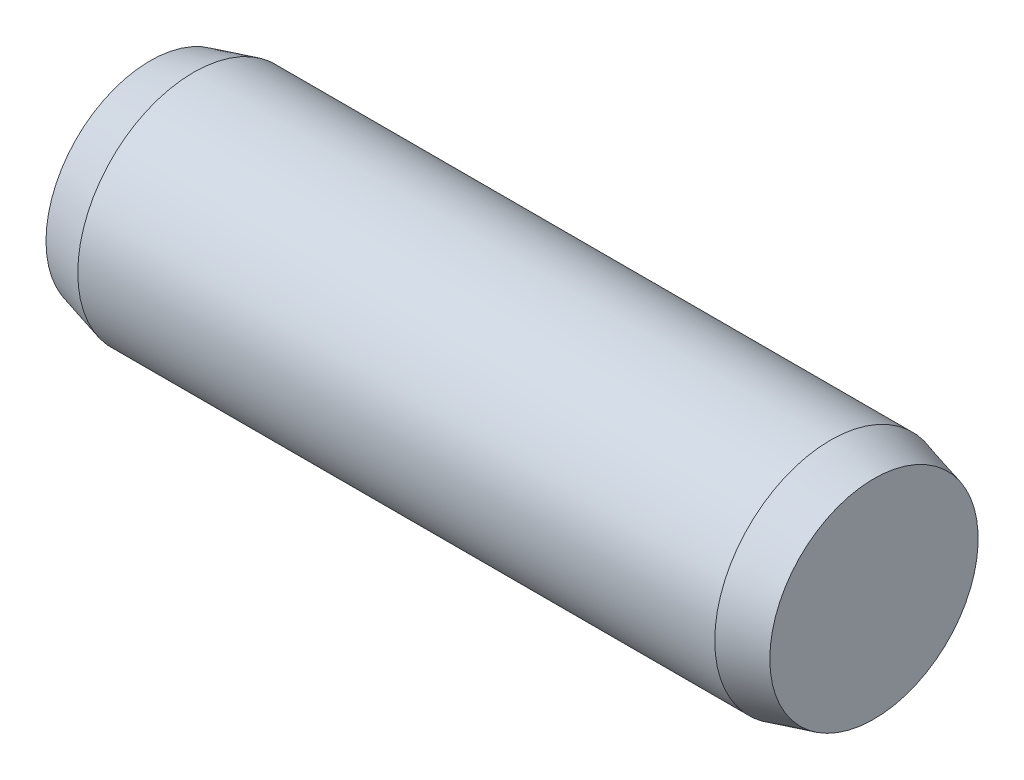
ISO-10303-21;
HEADER;
FILE_DESCRIPTION(('STEP AP214'),'2;1');
FILE_NAME('part.step','',(''),(''),'','','');
FILE_SCHEMA(('AUTOMOTIVE_DESIGN { 1 0 10303 214 1 1 1 1 }'));
ENDSEC;
DATA;
#1=APPLICATION_CONTEXT('core data for automotive mechanical design processes');
#2=APPLICATION_PROTOCOL_DEFINITION('international standard','automotive_design',2000,#1);
#3=PRODUCT_CONTEXT('',#1,'mechanical');
#4=PRODUCT('Part','Part','',(#3));
#5=PRODUCT_RELATED_PRODUCT_CATEGORY('part','',(#4));
#6=PRODUCT_DEFINITION_FORMATION('','',#4);
#7=PRODUCT_DEFINITION_CONTEXT('part definition',#1,'design');
#8=PRODUCT_DEFINITION('design','',#6,#7);
#9=PRODUCT_DEFINITION_SHAPE('','',#8);
#10=(LENGTH_UNIT() NAMED_UNIT(*) SI_UNIT(.MILLI.,.METRE.));
#11=(NAMED_UNIT(*) PLANE_ANGLE_UNIT() SI_UNIT($,.RADIAN.));
#12=(NAMED_UNIT(*) SI_UNIT($,.STERADIAN.) SOLID_ANGLE_UNIT());
#13=UNCERTAINTY_MEASURE_WITH_UNIT(LENGTH_MEASURE(1.E-05),#10,'distance_accuracy_value','');
#14=(GEOMETRIC_REPRESENTATION_CONTEXT(3) GLOBAL_UNCERTAINTY_ASSIGNED_CONTEXT((#13)) GLOBAL_UNIT_ASSIGNED_CONTEXT((#10,
#11,#12)) REPRESENTATION_CONTEXT('',''));
#15=CARTESIAN_POINT('',(0.,0.,0.));
#16=DIRECTION('',(0.,0.,1.));
#17=DIRECTION('',(1.,0.,0.));
#18=AXIS2_PLACEMENT_3D('',#15,#16,#17);
#19=CARTESIAN_POINT('',(0.,7.19615242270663,0.));
#20=DIRECTION('',(1.,0.,0.));
#21=DIRECTION('',(0.,0.,-1.));
#22=AXIS2_PLACEMENT_3D('',#19,#20,#21);
#23=PLANE('',#22);
#24=CARTESIAN_POINT('',(0.,0.,0.));
#25=DIRECTION('',(-1.,0.,0.));
#26=DIRECTION('',(0.,0.,1.));
#27=AXIS2_PLACEMENT_3D('',#24,#25,#26);
#28=CIRCLE('',#27,7.19615242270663);
#29=CARTESIAN_POINT('',(0.,0.,7.19615242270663));
#30=VERTEX_POINT('',#29);
#31=EDGE_CURVE('E10',#30,#30,#28,.T.);
#32=ORIENTED_EDGE('',*,*,#31,.T.);
#33=EDGE_LOOP('',(#32));
#34=FACE_BOUND('',#33,.T.);
#35=ADVANCED_FACE('F43',(#34),#23,.F.);
#36=CARTESIAN_POINT('',(3.,0.,0.));
#37=DIRECTION('',(1.,0.,0.));
#38=DIRECTION('',(0.,0.,-1.));
#39=AXIS2_PLACEMENT_3D('',#36,#37,#38);
#40=CONICAL_SURFACE('',#39,8.,0.26179938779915);
#41=ORIENTED_EDGE('',*,*,#31,.F.);
#42=EDGE_LOOP('',(#41));
#43=FACE_BOUND('',#42,.T.);
#44=CARTESIAN_POINT('',(3.,0.,0.));
#45=DIRECTION('',(-1.,0.,0.));
#46=DIRECTION('',(0.,0.,1.));
#47=AXIS2_PLACEMENT_3D('',#44,#45,#46);
#48=CIRCLE('',#47,8.);
#49=CARTESIAN_POINT('',(3.,0.,8.));
#50=VERTEX_POINT('',#49);
#51=EDGE_CURVE('E50',#50,#50,#48,.T.);
#52=ORIENTED_EDGE('',*,*,#51,.T.);
#53=EDGE_LOOP('',(#52));
#54=FACE_BOUND('',#53,.T.);
#55=ADVANCED_FACE('F79',(#43,#54),#40,.T.);
#56=CARTESIAN_POINT('',(-1.65571726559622,0.,0.));
#57=DIRECTION('',(-1.,0.,0.));
#58=DIRECTION('',(0.,0.,1.));
#59=AXIS2_PLACEMENT_3D('',#56,#57,#58);
#60=CYLINDRICAL_SURFACE('',#59,8.);
#61=ORIENTED_EDGE('',*,*,#51,.F.);
#62=EDGE_LOOP('',(#61));
#63=FACE_BOUND('',#62,.T.);
#64=CARTESIAN_POINT('',(47.,0.,0.));
#65=DIRECTION('',(-1.,0.,0.));
#66=DIRECTION('',(0.,0.,1.));
#67=AXIS2_PLACEMENT_3D('',#64,#65,#66);
#68=CIRCLE('',#67,8.);
#69=CARTESIAN_POINT('',(47.,0.,8.));
#70=VERTEX_POINT('',#69);
#71=EDGE_CURVE('E55',#70,#70,#68,.T.);
#72=ORIENTED_EDGE('',*,*,#71,.T.);
#73=EDGE_LOOP('',(#72));
#74=FACE_BOUND('',#73,.T.);
#75=ADVANCED_FACE('F75',(#63,#74),#60,.T.);
#76=CARTESIAN_POINT('',(50.,0.,0.));
#77=DIRECTION('',(-1.,0.,0.));
#78=DIRECTION('',(0.,0.,1.));
#79=AXIS2_PLACEMENT_3D('',#76,#77,#78);
#80=CONICAL_SURFACE('',#79,7.19615242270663,0.26179938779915);
#81=ORIENTED_EDGE('',*,*,#71,.F.);
#82=EDGE_LOOP('',(#81));
#83=FACE_BOUND('',#82,.T.);
#84=CARTESIAN_POINT('',(50.,0.,0.));
#85=DIRECTION('',(-1.,0.,0.));
#86=DIRECTION('',(0.,0.,1.));
#87=AXIS2_PLACEMENT_3D('',#84,#85,#86);
#88=CIRCLE('',#87,7.19615242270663);
#89=CARTESIAN_POINT('',(50.,0.,7.19615242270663));
#90=VERTEX_POINT('',#89);
#91=EDGE_CURVE('E60',#90,#90,#88,.T.);
#92=ORIENTED_EDGE('',*,*,#91,.T.);
#93=EDGE_LOOP('',(#92));
#94=FACE_BOUND('',#93,.T.);
#95=ADVANCED_FACE('F67',(#83,#94),#80,.T.);
#96=CARTESIAN_POINT('',(50.,0.,0.));
#97=DIRECTION('',(-1.,0.,0.));
#98=DIRECTION('',(0.,0.,1.));
#99=AXIS2_PLACEMENT_3D('',#96,#97,#98);
#100=PLANE('',#99);
#101=ORIENTED_EDGE('',*,*,#91,.F.);
#102=EDGE_LOOP('',(#101));
#103=FACE_BOUND('',#102,.T.);
#104=ADVANCED_FACE('F69',(#103),#100,.F.);
#105=CLOSED_SHELL('',(#35,#55,#75,#95,#104));
#106=MANIFOLD_SOLID_BREP('B2',#105);
#107=ADVANCED_BREP_SHAPE_REPRESENTATION('',(#18,#106),#14);
#108=SHAPE_DEFINITION_REPRESENTATION(#9,#107);
ENDSEC;
END-ISO-10303-21;
